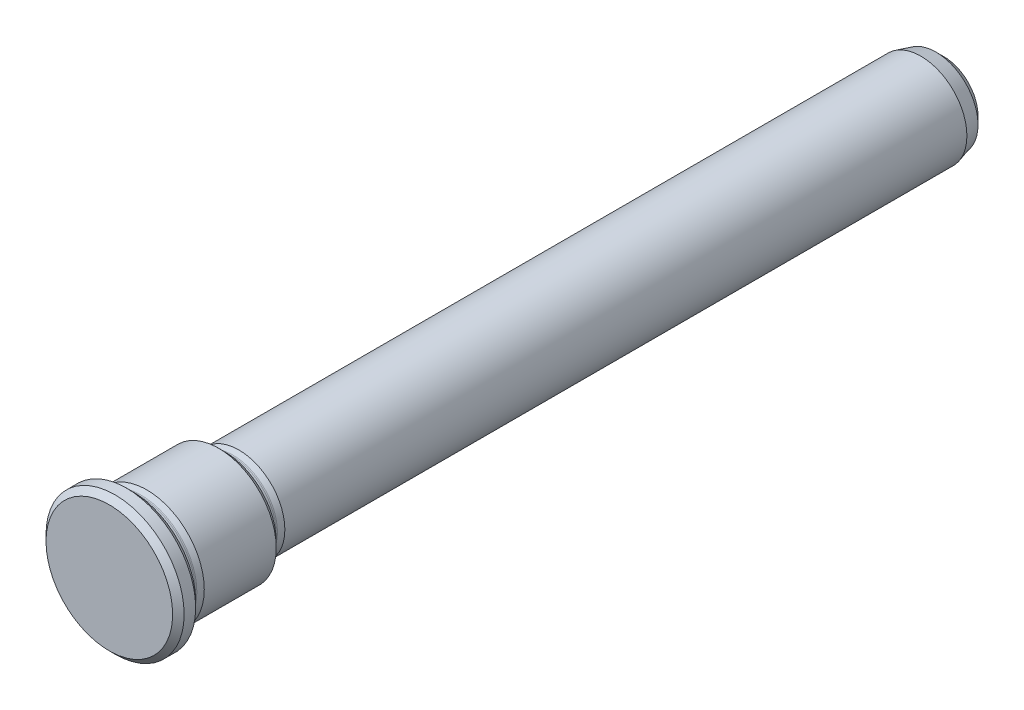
ISO-10303-21;
HEADER;
FILE_DESCRIPTION(('STEP AP214'),'2;1');
FILE_NAME('part.step','',(''),(''),'','','');
FILE_SCHEMA(('AUTOMOTIVE_DESIGN { 1 0 10303 214 1 1 1 1 }'));
ENDSEC;
DATA;
#1=APPLICATION_CONTEXT('core data for automotive mechanical design processes');
#2=APPLICATION_PROTOCOL_DEFINITION('international standard','automotive_design',2000,#1);
#3=PRODUCT_CONTEXT('',#1,'mechanical');
#4=PRODUCT('Part','Part','',(#3));
#5=PRODUCT_RELATED_PRODUCT_CATEGORY('part','',(#4));
#6=PRODUCT_DEFINITION_FORMATION('','',#4);
#7=PRODUCT_DEFINITION_CONTEXT('part definition',#1,'design');
#8=PRODUCT_DEFINITION('design','',#6,#7);
#9=PRODUCT_DEFINITION_SHAPE('','',#8);
#10=(LENGTH_UNIT() NAMED_UNIT(*) SI_UNIT(.MILLI.,.METRE.));
#11=(NAMED_UNIT(*) PLANE_ANGLE_UNIT() SI_UNIT($,.RADIAN.));
#12=(NAMED_UNIT(*) SI_UNIT($,.STERADIAN.) SOLID_ANGLE_UNIT());
#13=UNCERTAINTY_MEASURE_WITH_UNIT(LENGTH_MEASURE(1.E-05),#10,'distance_accuracy_value','');
#14=(GEOMETRIC_REPRESENTATION_CONTEXT(3) GLOBAL_UNCERTAINTY_ASSIGNED_CONTEXT((#13)) GLOBAL_UNIT_ASSIGNED_CONTEXT((#10,
#11,#12)) REPRESENTATION_CONTEXT('',''));
#15=CARTESIAN_POINT('',(0.,0.,0.));
#16=DIRECTION('',(0.,0.,1.));
#17=DIRECTION('',(1.,0.,0.));
#18=AXIS2_PLACEMENT_3D('',#15,#16,#17);
#19=CARTESIAN_POINT('',(0.,0.,0.));
#20=DIRECTION('',(0.,0.,-1.));
#21=DIRECTION('',(-1.,0.,0.));
#22=AXIS2_PLACEMENT_3D('',#19,#20,#21);
#23=PLANE('',#22);
#24=CARTESIAN_POINT('',(0.,0.,0.));
#25=DIRECTION('',(0.,0.,-1.));
#26=DIRECTION('',(-1.,0.,0.));
#27=AXIS2_PLACEMENT_3D('',#24,#25,#26);
#28=CIRCLE('',#27,11.);
#29=CARTESIAN_POINT('',(-11.,0.,0.));
#30=VERTEX_POINT('',#29);
#31=EDGE_CURVE('E9',#30,#30,#28,.F.);
#32=ORIENTED_EDGE('',*,*,#31,.T.);
#33=EDGE_LOOP('',(#32));
#34=FACE_BOUND('',#33,.T.);
#35=ADVANCED_FACE('F14',(#34),#23,.F.);
#36=CARTESIAN_POINT('',(0.,0.,0.));
#37=DIRECTION('',(0.,0.,1.));
#38=DIRECTION('',(1.,0.,0.));
#39=AXIS2_PLACEMENT_3D('',#36,#37,#38);
#40=CYLINDRICAL_SURFACE('',#39,12.);
#41=CARTESIAN_POINT('',(0.,0.,-3.));
#42=DIRECTION('',(0.,0.,1.));
#43=DIRECTION('',(1.,0.,0.));
#44=AXIS2_PLACEMENT_3D('',#41,#42,#43);
#45=CIRCLE('',#44,12.);
#46=CARTESIAN_POINT('',(12.,0.,-3.));
#47=VERTEX_POINT('',#46);
#48=EDGE_CURVE('E25',#47,#47,#45,.T.);
#49=ORIENTED_EDGE('',*,*,#48,.T.);
#50=EDGE_LOOP('',(#49));
#51=FACE_BOUND('',#50,.T.);
#52=CARTESIAN_POINT('',(0.,0.,-1.));
#53=DIRECTION('',(0.,0.,-1.));
#54=DIRECTION('',(-1.,0.,0.));
#55=AXIS2_PLACEMENT_3D('',#52,#53,#54);
#56=CIRCLE('',#55,12.);
#57=CARTESIAN_POINT('',(-12.,0.,-1.));
#58=VERTEX_POINT('',#57);
#59=EDGE_CURVE('E29',#58,#58,#56,.T.);
#60=ORIENTED_EDGE('',*,*,#59,.T.);
#61=EDGE_LOOP('',(#60));
#62=FACE_BOUND('',#61,.T.);
#63=ADVANCED_FACE('F100',(#51,#62),#40,.T.);
#64=CARTESIAN_POINT('',(0.,12.,-4.));
#65=DIRECTION('',(0.,0.,1.));
#66=DIRECTION('',(1.,0.,0.));
#67=AXIS2_PLACEMENT_3D('',#64,#65,#66);
#68=PLANE('',#67);
#69=CARTESIAN_POINT('',(0.,0.,-4.));
#70=DIRECTION('',(0.,0.,1.));
#71=DIRECTION('',(1.,0.,0.));
#72=AXIS2_PLACEMENT_3D('',#69,#70,#71);
#73=CIRCLE('',#72,11.);
#74=CARTESIAN_POINT('',(11.,0.,-4.));
#75=VERTEX_POINT('',#74);
#76=EDGE_CURVE('E21',#75,#75,#73,.F.);
#77=ORIENTED_EDGE('',*,*,#76,.T.);
#78=EDGE_LOOP('',(#77));
#79=FACE_BOUND('',#78,.T.);
#80=CARTESIAN_POINT('',(0.,0.,-4.));
#81=DIRECTION('',(0.,0.,1.));
#82=DIRECTION('',(1.,0.,0.));
#83=AXIS2_PLACEMENT_3D('',#80,#81,#82);
#84=CIRCLE('',#83,10.5);
#85=CARTESIAN_POINT('',(10.5,0.,-4.));
#86=VERTEX_POINT('',#85);
#87=EDGE_CURVE('E46',#86,#86,#84,.T.);
#88=ORIENTED_EDGE('',*,*,#87,.T.);
#89=EDGE_LOOP('',(#88));
#90=FACE_BOUND('',#89,.T.);
#91=ADVANCED_FACE('F106',(#79,#90),#68,.F.);
#92=CARTESIAN_POINT('',(0.,0.,-4.8));
#93=DIRECTION('',(0.,0.,1.));
#94=DIRECTION('',(1.,0.,0.));
#95=AXIS2_PLACEMENT_3D('',#92,#93,#94);
#96=TOROIDAL_SURFACE('',#95,10.5,0.8);
#97=ORIENTED_EDGE('',*,*,#87,.F.);
#98=EDGE_LOOP('',(#97));
#99=FACE_BOUND('',#98,.T.);
#100=CARTESIAN_POINT('',(0.,0.,-4.8));
#101=DIRECTION('',(0.,0.,1.));
#102=DIRECTION('',(1.,0.,0.));
#103=AXIS2_PLACEMENT_3D('',#100,#101,#102);
#104=CIRCLE('',#103,9.7);
#105=CARTESIAN_POINT('',(9.7,0.,-4.8));
#106=VERTEX_POINT('',#105);
#107=EDGE_CURVE('E49',#106,#106,#104,.T.);
#108=ORIENTED_EDGE('',*,*,#107,.T.);
#109=EDGE_LOOP('',(#108));
#110=FACE_BOUND('',#109,.T.);
#111=ADVANCED_FACE('F176',(#99,#110),#96,.F.);
#112=CARTESIAN_POINT('',(0.,0.,0.));
#113=DIRECTION('',(0.,0.,1.));
#114=DIRECTION('',(1.,0.,0.));
#115=AXIS2_PLACEMENT_3D('',#112,#113,#114);
#116=CYLINDRICAL_SURFACE('',#115,9.7);
#117=ORIENTED_EDGE('',*,*,#107,.F.);
#118=EDGE_LOOP('',(#117));
#119=FACE_BOUND('',#118,.T.);
#120=CARTESIAN_POINT('',(0.,0.,-5.27506275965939));
#121=DIRECTION('',(0.,0.,1.));
#122=DIRECTION('',(1.,0.,0.));
#123=AXIS2_PLACEMENT_3D('',#120,#121,#122);
#124=CIRCLE('',#123,9.7);
#125=CARTESIAN_POINT('',(9.7,0.,-5.27506275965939));
#126=VERTEX_POINT('',#125);
#127=EDGE_CURVE('E52',#126,#126,#124,.T.);
#128=ORIENTED_EDGE('',*,*,#127,.T.);
#129=EDGE_LOOP('',(#128));
#130=FACE_BOUND('',#129,.T.);
#131=ADVANCED_FACE('F232',(#119,#130),#116,.T.);
#132=CARTESIAN_POINT('',(0.,0.,-5.27506275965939));
#133=DIRECTION('',(0.,0.,1.));
#134=DIRECTION('',(1.,0.,0.));
#135=AXIS2_PLACEMENT_3D('',#132,#133,#134);
#136=TOROIDAL_SURFACE('',#135,10.5,0.8);
#137=ORIENTED_EDGE('',*,*,#127,.F.);
#138=EDGE_LOOP('',(#137));
#139=FACE_BOUND('',#138,.T.);
#140=CARTESIAN_POINT('',(0.,0.,-5.4821179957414));
#141=DIRECTION('',(0.,0.,1.));
#142=DIRECTION('',(1.,0.,0.));
#143=AXIS2_PLACEMENT_3D('',#140,#141,#142);
#144=CIRCLE('',#143,9.72725933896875);
#145=CARTESIAN_POINT('',(9.72725933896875,0.,-5.4821179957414));
#146=VERTEX_POINT('',#145);
#147=EDGE_CURVE('E55',#146,#146,#144,.T.);
#148=ORIENTED_EDGE('',*,*,#147,.T.);
#149=EDGE_LOOP('',(#148));
#150=FACE_BOUND('',#149,.T.);
#151=ADVANCED_FACE('F222',(#139,#150),#136,.F.);
#152=CARTESIAN_POINT('',(0.,0.,-6.5));
#153=DIRECTION('',(0.,0.,-1.));
#154=DIRECTION('',(-1.,0.,0.));
#155=AXIS2_PLACEMENT_3D('',#152,#153,#154);
#156=CONICAL_SURFACE('',#155,10.,0.261799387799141);
#157=ORIENTED_EDGE('',*,*,#147,.F.);
#158=EDGE_LOOP('',(#157));
#159=FACE_BOUND('',#158,.T.);
#160=CARTESIAN_POINT('',(0.,0.,-6.5));
#161=DIRECTION('',(0.,0.,1.));
#162=DIRECTION('',(1.,0.,0.));
#163=AXIS2_PLACEMENT_3D('',#160,#161,#162);
#164=CIRCLE('',#163,10.);
#165=CARTESIAN_POINT('',(10.,0.,-6.5));
#166=VERTEX_POINT('',#165);
#167=EDGE_CURVE('E58',#166,#166,#164,.T.);
#168=ORIENTED_EDGE('',*,*,#167,.T.);
#169=EDGE_LOOP('',(#168));
#170=FACE_BOUND('',#169,.T.);
#171=ADVANCED_FACE('F164',(#159,#170),#156,.T.);
#172=CARTESIAN_POINT('',(0.,0.,0.));
#173=DIRECTION('',(0.,0.,1.));
#174=DIRECTION('',(1.,0.,0.));
#175=AXIS2_PLACEMENT_3D('',#172,#173,#174);
#176=CYLINDRICAL_SURFACE('',#175,10.);
#177=CARTESIAN_POINT('',(0.,0.,-19.));
#178=DIRECTION('',(0.,0.,1.));
#179=DIRECTION('',(1.,0.,0.));
#180=AXIS2_PLACEMENT_3D('',#177,#178,#179);
#181=CIRCLE('',#180,10.);
#182=CARTESIAN_POINT('',(10.,0.,-19.));
#183=VERTEX_POINT('',#182);
#184=EDGE_CURVE('E37',#183,#183,#181,.T.);
#185=ORIENTED_EDGE('',*,*,#184,.T.);
#186=EDGE_LOOP('',(#185));
#187=FACE_BOUND('',#186,.T.);
#188=ORIENTED_EDGE('',*,*,#167,.F.);
#189=EDGE_LOOP('',(#188));
#190=FACE_BOUND('',#189,.T.);
#191=ADVANCED_FACE('F152',(#187,#190),#176,.T.);
#192=CARTESIAN_POINT('',(0.,10.,-20.));
#193=DIRECTION('',(0.,0.,1.));
#194=DIRECTION('',(1.,0.,0.));
#195=AXIS2_PLACEMENT_3D('',#192,#193,#194);
#196=PLANE('',#195);
#197=CARTESIAN_POINT('',(0.,0.,-20.));
#198=DIRECTION('',(0.,0.,1.));
#199=DIRECTION('',(1.,0.,0.));
#200=AXIS2_PLACEMENT_3D('',#197,#198,#199);
#201=CIRCLE('',#200,9.);
#202=CARTESIAN_POINT('',(9.,0.,-20.));
#203=VERTEX_POINT('',#202);
#204=EDGE_CURVE('E34',#203,#203,#201,.F.);
#205=ORIENTED_EDGE('',*,*,#204,.T.);
#206=EDGE_LOOP('',(#205));
#207=FACE_BOUND('',#206,.T.);
#208=CARTESIAN_POINT('',(0.,0.,-20.));
#209=DIRECTION('',(0.,0.,1.));
#210=DIRECTION('',(1.,0.,0.));
#211=AXIS2_PLACEMENT_3D('',#208,#209,#210);
#212=CIRCLE('',#211,8.5);
#213=CARTESIAN_POINT('',(8.5,0.,-20.));
#214=VERTEX_POINT('',#213);
#215=EDGE_CURVE('E61',#214,#214,#212,.T.);
#216=ORIENTED_EDGE('',*,*,#215,.T.);
#217=EDGE_LOOP('',(#216));
#218=FACE_BOUND('',#217,.T.);
#219=ADVANCED_FACE('F146',(#207,#218),#196,.F.);
#220=CARTESIAN_POINT('',(0.,0.,-20.8));
#221=DIRECTION('',(0.,0.,1.));
#222=DIRECTION('',(1.,0.,0.));
#223=AXIS2_PLACEMENT_3D('',#220,#221,#222);
#224=TOROIDAL_SURFACE('',#223,8.5,0.8);
#225=ORIENTED_EDGE('',*,*,#215,.F.);
#226=EDGE_LOOP('',(#225));
#227=FACE_BOUND('',#226,.T.);
#228=CARTESIAN_POINT('',(0.,0.,-20.8));
#229=DIRECTION('',(0.,0.,1.));
#230=DIRECTION('',(1.,0.,0.));
#231=AXIS2_PLACEMENT_3D('',#228,#229,#230);
#232=CIRCLE('',#231,7.7);
#233=CARTESIAN_POINT('',(7.7,0.,-20.8));
#234=VERTEX_POINT('',#233);
#235=EDGE_CURVE('E64',#234,#234,#232,.T.);
#236=ORIENTED_EDGE('',*,*,#235,.T.);
#237=EDGE_LOOP('',(#236));
#238=FACE_BOUND('',#237,.T.);
#239=ADVANCED_FACE('F151',(#227,#238),#224,.F.);
#240=CARTESIAN_POINT('',(0.,0.,0.));
#241=DIRECTION('',(0.,0.,1.));
#242=DIRECTION('',(1.,0.,0.));
#243=AXIS2_PLACEMENT_3D('',#240,#241,#242);
#244=CYLINDRICAL_SURFACE('',#243,7.7);
#245=ORIENTED_EDGE('',*,*,#235,.F.);
#246=EDGE_LOOP('',(#245));
#247=FACE_BOUND('',#246,.T.);
#248=CARTESIAN_POINT('',(0.,0.,-21.2750627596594));
#249=DIRECTION('',(0.,0.,1.));
#250=DIRECTION('',(1.,0.,0.));
#251=AXIS2_PLACEMENT_3D('',#248,#249,#250);
#252=CIRCLE('',#251,7.7);
#253=CARTESIAN_POINT('',(7.7,0.,-21.2750627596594));
#254=VERTEX_POINT('',#253);
#255=EDGE_CURVE('E67',#254,#254,#252,.T.);
#256=ORIENTED_EDGE('',*,*,#255,.T.);
#257=EDGE_LOOP('',(#256));
#258=FACE_BOUND('',#257,.T.);
#259=ADVANCED_FACE('F198',(#247,#258),#244,.T.);
#260=CARTESIAN_POINT('',(0.,0.,-21.2750627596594));
#261=DIRECTION('',(0.,0.,1.));
#262=DIRECTION('',(1.,0.,0.));
#263=AXIS2_PLACEMENT_3D('',#260,#261,#262);
#264=TOROIDAL_SURFACE('',#263,8.5,0.8);
#265=ORIENTED_EDGE('',*,*,#255,.F.);
#266=EDGE_LOOP('',(#265));
#267=FACE_BOUND('',#266,.T.);
#268=CARTESIAN_POINT('',(0.,0.,-21.4821179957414));
#269=DIRECTION('',(0.,0.,1.));
#270=DIRECTION('',(1.,0.,0.));
#271=AXIS2_PLACEMENT_3D('',#268,#269,#270);
#272=CIRCLE('',#271,7.72725933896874);
#273=CARTESIAN_POINT('',(7.72725933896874,0.,-21.4821179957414));
#274=VERTEX_POINT('',#273);
#275=EDGE_CURVE('E70',#274,#274,#272,.T.);
#276=ORIENTED_EDGE('',*,*,#275,.T.);
#277=EDGE_LOOP('',(#276));
#278=FACE_BOUND('',#277,.T.);
#279=ADVANCED_FACE('F187',(#267,#278),#264,.F.);
#280=CARTESIAN_POINT('',(0.,0.,-22.5));
#281=DIRECTION('',(0.,0.,-1.));
#282=DIRECTION('',(-1.,0.,0.));
#283=AXIS2_PLACEMENT_3D('',#280,#281,#282);
#284=CONICAL_SURFACE('',#283,8.,0.261799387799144);
#285=ORIENTED_EDGE('',*,*,#275,.F.);
#286=EDGE_LOOP('',(#285));
#287=FACE_BOUND('',#286,.T.);
#288=CARTESIAN_POINT('',(0.,0.,-22.5));
#289=DIRECTION('',(0.,0.,1.));
#290=DIRECTION('',(1.,0.,0.));
#291=AXIS2_PLACEMENT_3D('',#288,#289,#290);
#292=CIRCLE('',#291,8.);
#293=CARTESIAN_POINT('',(8.,0.,-22.5));
#294=VERTEX_POINT('',#293);
#295=EDGE_CURVE('E73',#294,#294,#292,.T.);
#296=ORIENTED_EDGE('',*,*,#295,.T.);
#297=EDGE_LOOP('',(#296));
#298=FACE_BOUND('',#297,.T.);
#299=ADVANCED_FACE('F96',(#287,#298),#284,.T.);
#300=CARTESIAN_POINT('',(0.,0.,0.));
#301=DIRECTION('',(0.,0.,1.));
#302=DIRECTION('',(1.,0.,0.));
#303=AXIS2_PLACEMENT_3D('',#300,#301,#302);
#304=CYLINDRICAL_SURFACE('',#303,8.);
#305=ORIENTED_EDGE('',*,*,#295,.F.);
#306=EDGE_LOOP('',(#305));
#307=FACE_BOUND('',#306,.T.);
#308=CARTESIAN_POINT('',(0.,0.,-141.));
#309=DIRECTION('',(0.,0.,1.));
#310=DIRECTION('',(1.,0.,0.));
#311=AXIS2_PLACEMENT_3D('',#308,#309,#310);
#312=CIRCLE('',#311,8.);
#313=CARTESIAN_POINT('',(8.,0.,-141.));
#314=VERTEX_POINT('',#313);
#315=EDGE_CURVE('E76',#314,#314,#312,.T.);
#316=ORIENTED_EDGE('',*,*,#315,.T.);
#317=EDGE_LOOP('',(#316));
#318=FACE_BOUND('',#317,.T.);
#319=ADVANCED_FACE('F80',(#307,#318),#304,.T.);
#320=CARTESIAN_POINT('',(0.,0.,-145.));
#321=DIRECTION('',(0.,0.,1.));
#322=DIRECTION('',(1.,0.,0.));
#323=AXIS2_PLACEMENT_3D('',#320,#321,#322);
#324=CONICAL_SURFACE('',#323,6.92820323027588,0.261799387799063);
#325=CARTESIAN_POINT('',(0.,0.,-143.633974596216));
#326=DIRECTION('',(0.,0.,-1.));
#327=DIRECTION('',(-1.,0.,0.));
#328=AXIS2_PLACEMENT_3D('',#325,#326,#327);
#329=CIRCLE('',#328,7.29422863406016);
#330=CARTESIAN_POINT('',(-7.29422863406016,0.,-143.633974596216));
#331=VERTEX_POINT('',#330);
#332=EDGE_CURVE('E43',#331,#331,#329,.F.);
#333=ORIENTED_EDGE('',*,*,#332,.T.);
#334=EDGE_LOOP('',(#333));
#335=FACE_BOUND('',#334,.T.);
#336=ORIENTED_EDGE('',*,*,#315,.F.);
#337=EDGE_LOOP('',(#336));
#338=FACE_BOUND('',#337,.T.);
#339=ADVANCED_FACE('F82',(#335,#338),#324,.T.);
#340=CARTESIAN_POINT('',(0.,6.92820323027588,-145.));
#341=DIRECTION('',(0.,0.,1.));
#342=DIRECTION('',(1.,0.,0.));
#343=AXIS2_PLACEMENT_3D('',#340,#341,#342);
#344=PLANE('',#343);
#345=CARTESIAN_POINT('',(0.,0.,-145.));
#346=DIRECTION('',(0.,0.,1.));
#347=DIRECTION('',(1.,0.,0.));
#348=AXIS2_PLACEMENT_3D('',#345,#346,#347);
#349=CIRCLE('',#348,5.92820323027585);
#350=CARTESIAN_POINT('',(5.92820323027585,0.,-145.));
#351=VERTEX_POINT('',#350);
#352=EDGE_CURVE('E40',#351,#351,#349,.F.);
#353=ORIENTED_EDGE('',*,*,#352,.T.);
#354=EDGE_LOOP('',(#353));
#355=FACE_BOUND('',#354,.T.);
#356=ADVANCED_FACE('F84',(#355),#344,.F.);
#357=CARTESIAN_POINT('',(0.,0.,-143.633974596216));
#358=DIRECTION('',(0.,0.,1.));
#359=DIRECTION('',(1.,0.,0.));
#360=AXIS2_PLACEMENT_3D('',#357,#358,#359);
#361=CONICAL_SURFACE('',#360,7.29422863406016,0.785398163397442);
#362=ORIENTED_EDGE('',*,*,#352,.F.);
#363=EDGE_LOOP('',(#362));
#364=FACE_BOUND('',#363,.T.);
#365=ORIENTED_EDGE('',*,*,#332,.F.);
#366=EDGE_LOOP('',(#365));
#367=FACE_BOUND('',#366,.T.);
#368=ADVANCED_FACE('F93',(#364,#367),#361,.T.);
#369=CARTESIAN_POINT('',(0.,0.,-19.));
#370=DIRECTION('',(0.,0.,1.));
#371=DIRECTION('',(1.,0.,0.));
#372=AXIS2_PLACEMENT_3D('',#369,#370,#371);
#373=CONICAL_SURFACE('',#372,10.,0.78539816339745);
#374=ORIENTED_EDGE('',*,*,#204,.F.);
#375=EDGE_LOOP('',(#374));
#376=FACE_BOUND('',#375,.T.);
#377=ORIENTED_EDGE('',*,*,#184,.F.);
#378=EDGE_LOOP('',(#377));
#379=FACE_BOUND('',#378,.T.);
#380=ADVANCED_FACE('F113',(#376,#379),#373,.T.);
#381=CARTESIAN_POINT('',(0.,0.,-3.));
#382=DIRECTION('',(0.,0.,1.));
#383=DIRECTION('',(1.,0.,0.));
#384=AXIS2_PLACEMENT_3D('',#381,#382,#383);
#385=CONICAL_SURFACE('',#384,12.,0.785398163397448);
#386=ORIENTED_EDGE('',*,*,#76,.F.);
#387=EDGE_LOOP('',(#386));
#388=FACE_BOUND('',#387,.T.);
#389=ORIENTED_EDGE('',*,*,#48,.F.);
#390=EDGE_LOOP('',(#389));
#391=FACE_BOUND('',#390,.T.);
#392=ADVANCED_FACE('F116',(#388,#391),#385,.T.);
#393=CARTESIAN_POINT('',(0.,0.,0.));
#394=DIRECTION('',(0.,0.,-1.));
#395=DIRECTION('',(-1.,0.,0.));
#396=AXIS2_PLACEMENT_3D('',#393,#394,#395);
#397=CONICAL_SURFACE('',#396,11.,0.785398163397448);
#398=ORIENTED_EDGE('',*,*,#59,.F.);
#399=EDGE_LOOP('',(#398));
#400=FACE_BOUND('',#399,.T.);
#401=ORIENTED_EDGE('',*,*,#31,.F.);
#402=EDGE_LOOP('',(#401));
#403=FACE_BOUND('',#402,.T.);
#404=ADVANCED_FACE('F16',(#400,#403),#397,.T.);
#405=CLOSED_SHELL('',(#35,#63,#91,#111,#131,#151,#171,#191,#219,#239,#259,#279,#299,#319,#339,
#356,#368,#380,#392,#404));
#406=MANIFOLD_SOLID_BREP('B1',#405);
#407=ADVANCED_BREP_SHAPE_REPRESENTATION('',(#18,#406),#14);
#408=SHAPE_DEFINITION_REPRESENTATION(#9,#407);
ENDSEC;
END-ISO-10303-21;
